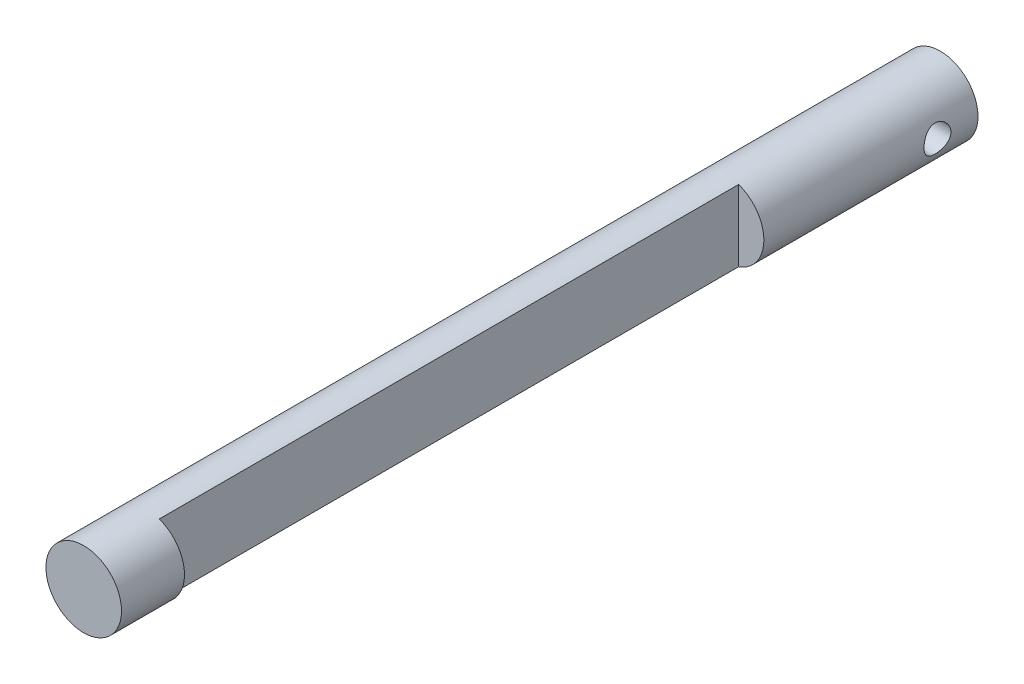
from build123d import *

# Parameters (mm, degrees)
ESQUISSE1_R             = 0.75
BASE_EXTRUSION_DEPTH    = 17
ESQUISSE2_W             = 3.121840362
ESQUISSE2_H             = 11.5
ENL_V_MAT_EXTRU_1_DEPTH = 5
ESQUISSE5_R             = 0.267547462
ENL_V_MAT_EXTRU_2_DEPTH = 1


with BuildPart() as part:
    # Esquisse1 → Base-Extrusion (new body)
    with BuildSketch(Plane.XY):
        Circle(ESQUISSE1_R)
    extrude(amount=BASE_EXTRUSION_DEPTH)

    # Esquisse2 → Enl_v. mat.-Extru.1 (cut, symmetric)
    with BuildSketch(Plane(origin=(0, 0, 0), x_dir=(1, 0, 0), z_dir=(0, 1, 0))):
        with Locations((1.810920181, -10)):
            Rectangle(ESQUISSE2_W, ESQUISSE2_H)
    extrude(amount=ENL_V_MAT_EXTRU_1_DEPTH, both=True, mode=Mode.SUBTRACT)

    # Esquisse5 → Enl_v. mat.-Extru.2 (cut, symmetric)
    with BuildSketch(Plane(origin=(0, 0, 0), x_dir=(0, 0, -1), z_dir=(1, 0, 0))):
        with Locations(Location((-0.803581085, 0, 0), (0, 0, 180))):
            Circle(ESQUISSE5_R)
    extrude(amount=ENL_V_MAT_EXTRU_2_DEPTH, both=True, mode=Mode.SUBTRACT)


solid = part.part
